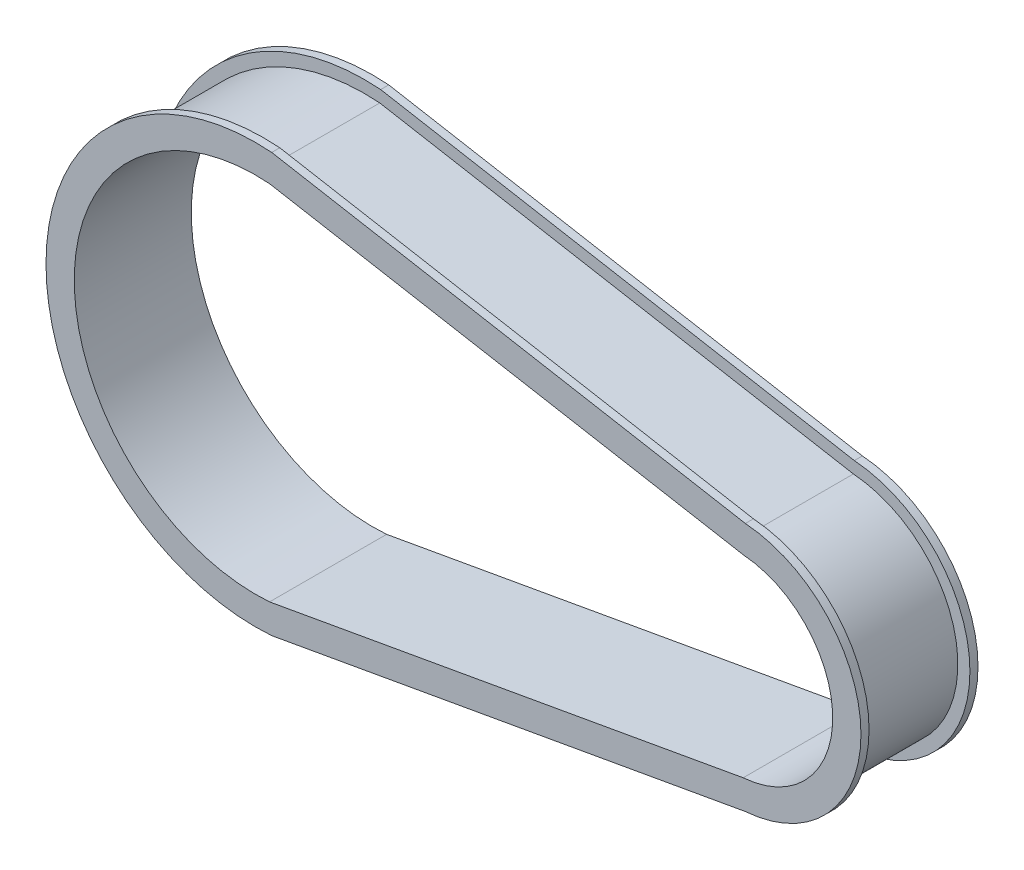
ISO-10303-21;
HEADER;
FILE_DESCRIPTION(('STEP AP214'),'2;1');
FILE_NAME('part.step','',(''),(''),'','','');
FILE_SCHEMA(('AUTOMOTIVE_DESIGN { 1 0 10303 214 1 1 1 1 }'));
ENDSEC;
DATA;
#1=APPLICATION_CONTEXT('core data for automotive mechanical design processes');
#2=APPLICATION_PROTOCOL_DEFINITION('international standard','automotive_design',2000,#1);
#3=PRODUCT_CONTEXT('',#1,'mechanical');
#4=PRODUCT('Part','Part','',(#3));
#5=PRODUCT_RELATED_PRODUCT_CATEGORY('part','',(#4));
#6=PRODUCT_DEFINITION_FORMATION('','',#4);
#7=PRODUCT_DEFINITION_CONTEXT('part definition',#1,'design');
#8=PRODUCT_DEFINITION('design','',#6,#7);
#9=PRODUCT_DEFINITION_SHAPE('','',#8);
#10=(LENGTH_UNIT() NAMED_UNIT(*) SI_UNIT(.MILLI.,.METRE.));
#11=(NAMED_UNIT(*) PLANE_ANGLE_UNIT() SI_UNIT($,.RADIAN.));
#12=(NAMED_UNIT(*) SI_UNIT($,.STERADIAN.) SOLID_ANGLE_UNIT());
#13=UNCERTAINTY_MEASURE_WITH_UNIT(LENGTH_MEASURE(1.E-05),#10,'distance_accuracy_value','');
#14=(GEOMETRIC_REPRESENTATION_CONTEXT(3) GLOBAL_UNCERTAINTY_ASSIGNED_CONTEXT((#13)) GLOBAL_UNIT_ASSIGNED_CONTEXT((#10,
#11,#12)) REPRESENTATION_CONTEXT('',''));
#15=CARTESIAN_POINT('',(0.,0.,0.));
#16=DIRECTION('',(0.,0.,1.));
#17=DIRECTION('',(1.,0.,0.));
#18=AXIS2_PLACEMENT_3D('',#15,#16,#17);
#19=CARTESIAN_POINT('',(0.,0.,6.25));
#20=DIRECTION('',(0.,0.,-1.));
#21=DIRECTION('',(-1.,0.,0.));
#22=AXIS2_PLACEMENT_3D('',#19,#20,#21);
#23=CYLINDRICAL_SURFACE('',#22,12.25);
#24=CARTESIAN_POINT('',(0.,0.,0.));
#25=DIRECTION('',(0.,0.,1.));
#26=DIRECTION('',(1.,0.,0.));
#27=AXIS2_PLACEMENT_3D('',#24,#25,#26);
#28=CIRCLE('',#27,12.25);
#29=CARTESIAN_POINT('',(0.926782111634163,12.2148915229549,0.));
#30=VERTEX_POINT('',#29);
#31=CARTESIAN_POINT('',(0.926782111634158,-12.2148915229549,0.));
#32=VERTEX_POINT('',#31);
#33=EDGE_CURVE('E248',#30,#32,#28,.T.);
#34=ORIENTED_EDGE('',*,*,#33,.T.);
#35=DIRECTION('',(0.,0.,-1.));
#36=VECTOR('',#35,1.);
#37=CARTESIAN_POINT('',(0.926782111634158,-12.2148915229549,6.25));
#38=LINE('',#37,#36);
#39=CARTESIAN_POINT('',(0.926782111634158,-12.2148915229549,6.25));
#40=VERTEX_POINT('',#39);
#41=EDGE_CURVE('E11',#40,#32,#38,.T.);
#42=ORIENTED_EDGE('',*,*,#41,.F.);
#43=CARTESIAN_POINT('',(0.,0.,6.25));
#44=DIRECTION('',(0.,0.,1.));
#45=DIRECTION('',(1.,0.,0.));
#46=AXIS2_PLACEMENT_3D('',#43,#44,#45);
#47=CIRCLE('',#46,12.25);
#48=CARTESIAN_POINT('',(0.926782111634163,12.2148915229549,6.25));
#49=VERTEX_POINT('',#48);
#50=EDGE_CURVE('E258',#49,#40,#47,.T.);
#51=ORIENTED_EDGE('',*,*,#50,.F.);
#52=DIRECTION('',(0.,0.,-1.));
#53=VECTOR('',#52,1.);
#54=CARTESIAN_POINT('',(0.926782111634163,12.2148915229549,6.25));
#55=LINE('',#54,#53);
#56=EDGE_CURVE('E270',#49,#30,#55,.T.);
#57=ORIENTED_EDGE('',*,*,#56,.T.);
#58=EDGE_LOOP('',(#34,#42,#51,#57));
#59=FACE_BOUND('',#58,.T.);
#60=ADVANCED_FACE('F30',(#59),#23,.T.);
#61=CARTESIAN_POINT('',(0.926782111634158,-12.2148915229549,6.25));
#62=DIRECTION('',(-0.175633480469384,0.984455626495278,0.));
#63=DIRECTION('',(-0.984455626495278,-0.175633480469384,0.));
#64=AXIS2_PLACEMENT_3D('',#61,#62,#63);
#65=PLANE('',#64);
#66=DIRECTION('',(0.984455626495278,0.175633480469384,0.));
#67=VECTOR('',#66,1.);
#68=CARTESIAN_POINT('',(0.926782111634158,-12.2148915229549,0.));
#69=LINE('',#68,#67);
#70=CARTESIAN_POINT('',(30.2695897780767,-6.97993801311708,0.));
#71=VERTEX_POINT('',#70);
#72=EDGE_CURVE('E251',#32,#71,#69,.T.);
#73=ORIENTED_EDGE('',*,*,#72,.T.);
#74=DIRECTION('',(0.,0.,-1.));
#75=VECTOR('',#74,1.);
#76=CARTESIAN_POINT('',(30.2695897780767,-6.97993801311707,6.25));
#77=LINE('',#76,#75);
#78=CARTESIAN_POINT('',(30.2695897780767,-6.97993801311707,6.25));
#79=VERTEX_POINT('',#78);
#80=EDGE_CURVE('E37',#79,#71,#77,.T.);
#81=ORIENTED_EDGE('',*,*,#80,.F.);
#82=DIRECTION('',(0.984455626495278,0.175633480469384,0.));
#83=VECTOR('',#82,1.);
#84=CARTESIAN_POINT('',(0.926782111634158,-12.2148915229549,6.25));
#85=LINE('',#84,#83);
#86=EDGE_CURVE('E261',#40,#79,#85,.T.);
#87=ORIENTED_EDGE('',*,*,#86,.F.);
#88=ORIENTED_EDGE('',*,*,#41,.T.);
#89=EDGE_LOOP('',(#73,#81,#87,#88));
#90=FACE_BOUND('',#89,.T.);
#91=ADVANCED_FACE('F277',(#90),#65,.F.);
#92=CARTESIAN_POINT('',(29.74,0.,6.25));
#93=DIRECTION('',(0.,0.,-1.));
#94=DIRECTION('',(-1.,0.,0.));
#95=AXIS2_PLACEMENT_3D('',#92,#93,#94);
#96=CYLINDRICAL_SURFACE('',#95,7.);
#97=CARTESIAN_POINT('',(29.74,0.,0.));
#98=DIRECTION('',(0.,0.,1.));
#99=DIRECTION('',(1.,0.,0.));
#100=AXIS2_PLACEMENT_3D('',#97,#98,#99);
#101=CIRCLE('',#100,7.);
#102=CARTESIAN_POINT('',(30.2695897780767,6.97993801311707,0.));
#103=VERTEX_POINT('',#102);
#104=EDGE_CURVE('E253',#71,#103,#101,.T.);
#105=ORIENTED_EDGE('',*,*,#104,.T.);
#106=DIRECTION('',(0.,0.,-1.));
#107=VECTOR('',#106,1.);
#108=CARTESIAN_POINT('',(30.2695897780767,6.97993801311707,6.25));
#109=LINE('',#108,#107);
#110=CARTESIAN_POINT('',(30.2695897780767,6.97993801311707,6.25));
#111=VERTEX_POINT('',#110);
#112=EDGE_CURVE('E44',#111,#103,#109,.T.);
#113=ORIENTED_EDGE('',*,*,#112,.F.);
#114=CARTESIAN_POINT('',(29.74,0.,6.25));
#115=DIRECTION('',(0.,0.,1.));
#116=DIRECTION('',(1.,0.,0.));
#117=AXIS2_PLACEMENT_3D('',#114,#115,#116);
#118=CIRCLE('',#117,7.);
#119=EDGE_CURVE('E264',#79,#111,#118,.T.);
#120=ORIENTED_EDGE('',*,*,#119,.F.);
#121=ORIENTED_EDGE('',*,*,#80,.T.);
#122=EDGE_LOOP('',(#105,#113,#120,#121));
#123=FACE_BOUND('',#122,.T.);
#124=ADVANCED_FACE('F273',(#123),#96,.T.);
#125=CARTESIAN_POINT('',(0.926782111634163,12.2148915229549,6.25));
#126=DIRECTION('',(-0.175633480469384,-0.984455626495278,0.));
#127=DIRECTION('',(0.984455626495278,-0.175633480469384,0.));
#128=AXIS2_PLACEMENT_3D('',#125,#126,#127);
#129=PLANE('',#128);
#130=DIRECTION('',(-0.984455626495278,0.175633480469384,0.));
#131=VECTOR('',#130,1.);
#132=CARTESIAN_POINT('',(0.926782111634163,12.2148915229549,0.));
#133=LINE('',#132,#131);
#134=EDGE_CURVE('E255',#103,#30,#133,.T.);
#135=ORIENTED_EDGE('',*,*,#134,.T.);
#136=ORIENTED_EDGE('',*,*,#56,.F.);
#137=DIRECTION('',(-0.984455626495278,0.175633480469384,0.));
#138=VECTOR('',#137,1.);
#139=CARTESIAN_POINT('',(0.926782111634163,12.2148915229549,6.25));
#140=LINE('',#139,#138);
#141=EDGE_CURVE('E267',#111,#49,#140,.T.);
#142=ORIENTED_EDGE('',*,*,#141,.F.);
#143=ORIENTED_EDGE('',*,*,#112,.T.);
#144=EDGE_LOOP('',(#135,#136,#142,#143));
#145=FACE_BOUND('',#144,.T.);
#146=ADVANCED_FACE('F283',(#145),#129,.F.);
#147=CARTESIAN_POINT('',(0.,0.,6.25));
#148=DIRECTION('',(0.,0.,-1.));
#149=DIRECTION('',(-1.,0.,0.));
#150=AXIS2_PLACEMENT_3D('',#147,#148,#149);
#151=CYLINDRICAL_SURFACE('',#150,11.25);
#152=DIRECTION('',(0.,0.,-1.));
#153=VECTOR('',#152,1.);
#154=CARTESIAN_POINT('',(0.851126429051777,-11.217757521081,6.25));
#155=LINE('',#154,#153);
#156=CARTESIAN_POINT('',(0.851126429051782,-11.217757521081,6.75));
#157=VERTEX_POINT('',#156);
#158=CARTESIAN_POINT('',(0.851126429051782,-11.217757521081,-0.5));
#159=VERTEX_POINT('',#158);
#160=EDGE_CURVE('E160',#157,#159,#155,.T.);
#161=ORIENTED_EDGE('',*,*,#160,.T.);
#162=CARTESIAN_POINT('',(0.,0.,-0.5));
#163=DIRECTION('',(0.,0.,1.));
#164=DIRECTION('',(1.,0.,0.));
#165=AXIS2_PLACEMENT_3D('',#162,#163,#164);
#166=CIRCLE('',#165,11.25);
#167=CARTESIAN_POINT('',(0.851126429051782,11.217757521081,-0.5));
#168=VERTEX_POINT('',#167);
#169=EDGE_CURVE('E158',#168,#159,#166,.T.);
#170=ORIENTED_EDGE('',*,*,#169,.F.);
#171=DIRECTION('',(0.,0.,-1.));
#172=VECTOR('',#171,1.);
#173=CARTESIAN_POINT('',(0.851126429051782,11.217757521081,6.25));
#174=LINE('',#173,#172);
#175=CARTESIAN_POINT('',(0.851126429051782,11.217757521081,6.75));
#176=VERTEX_POINT('',#175);
#177=EDGE_CURVE('E143',#176,#168,#174,.T.);
#178=ORIENTED_EDGE('',*,*,#177,.F.);
#179=CARTESIAN_POINT('',(0.,0.,6.75));
#180=DIRECTION('',(0.,0.,1.));
#181=DIRECTION('',(1.,0.,0.));
#182=AXIS2_PLACEMENT_3D('',#179,#180,#181);
#183=CIRCLE('',#182,11.25);
#184=EDGE_CURVE('E206',#176,#157,#183,.T.);
#185=ORIENTED_EDGE('',*,*,#184,.T.);
#186=EDGE_LOOP('',(#161,#170,#178,#185));
#187=FACE_BOUND('',#186,.T.);
#188=ADVANCED_FACE('F159',(#187),#151,.F.);
#189=CARTESIAN_POINT('',(0.851126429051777,-11.217757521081,6.25));
#190=DIRECTION('',(-0.175633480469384,0.984455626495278,0.));
#191=DIRECTION('',(-0.984455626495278,-0.175633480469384,0.));
#192=AXIS2_PLACEMENT_3D('',#189,#190,#191);
#193=PLANE('',#192);
#194=DIRECTION('',(0.,0.,-1.));
#195=VECTOR('',#194,1.);
#196=CARTESIAN_POINT('',(30.1939340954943,-5.98280401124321,6.25));
#197=LINE('',#196,#195);
#198=CARTESIAN_POINT('',(30.1939340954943,-5.98280401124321,6.75));
#199=VERTEX_POINT('',#198);
#200=CARTESIAN_POINT('',(30.1939340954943,-5.98280401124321,-0.5));
#201=VERTEX_POINT('',#200);
#202=EDGE_CURVE('E245',#199,#201,#197,.T.);
#203=ORIENTED_EDGE('',*,*,#202,.T.);
#204=DIRECTION('',(0.984455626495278,0.175633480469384,0.));
#205=VECTOR('',#204,1.);
#206=CARTESIAN_POINT('',(0.851126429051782,-11.217757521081,-0.5));
#207=LINE('',#206,#205);
#208=EDGE_CURVE('E170',#159,#201,#207,.T.);
#209=ORIENTED_EDGE('',*,*,#208,.F.);
#210=ORIENTED_EDGE('',*,*,#160,.F.);
#211=DIRECTION('',(0.984455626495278,0.175633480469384,0.));
#212=VECTOR('',#211,1.);
#213=CARTESIAN_POINT('',(0.851126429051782,-11.217757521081,6.75));
#214=LINE('',#213,#212);
#215=EDGE_CURVE('E208',#157,#199,#214,.T.);
#216=ORIENTED_EDGE('',*,*,#215,.T.);
#217=EDGE_LOOP('',(#203,#209,#210,#216));
#218=FACE_BOUND('',#217,.T.);
#219=ADVANCED_FACE('F290',(#218),#193,.T.);
#220=CARTESIAN_POINT('',(29.74,0.,6.25));
#221=DIRECTION('',(0.,0.,-1.));
#222=DIRECTION('',(-1.,0.,0.));
#223=AXIS2_PLACEMENT_3D('',#220,#221,#222);
#224=CYLINDRICAL_SURFACE('',#223,6.);
#225=DIRECTION('',(0.,0.,-1.));
#226=VECTOR('',#225,1.);
#227=CARTESIAN_POINT('',(30.1939340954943,5.9828040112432,6.25));
#228=LINE('',#227,#226);
#229=CARTESIAN_POINT('',(30.1939340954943,5.98280401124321,6.75));
#230=VERTEX_POINT('',#229);
#231=CARTESIAN_POINT('',(30.1939340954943,5.9828040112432,-0.5));
#232=VERTEX_POINT('',#231);
#233=EDGE_CURVE('E154',#230,#232,#228,.T.);
#234=ORIENTED_EDGE('',*,*,#233,.T.);
#235=CARTESIAN_POINT('',(29.74,0.,-0.5));
#236=DIRECTION('',(0.,0.,1.));
#237=DIRECTION('',(1.,0.,0.));
#238=AXIS2_PLACEMENT_3D('',#235,#236,#237);
#239=CIRCLE('',#238,6.);
#240=EDGE_CURVE('E168',#201,#232,#239,.T.);
#241=ORIENTED_EDGE('',*,*,#240,.F.);
#242=ORIENTED_EDGE('',*,*,#202,.F.);
#243=CARTESIAN_POINT('',(29.74,0.,6.75));
#244=DIRECTION('',(0.,0.,1.));
#245=DIRECTION('',(1.,0.,0.));
#246=AXIS2_PLACEMENT_3D('',#243,#244,#245);
#247=CIRCLE('',#246,6.);
#248=EDGE_CURVE('E211',#199,#230,#247,.T.);
#249=ORIENTED_EDGE('',*,*,#248,.T.);
#250=EDGE_LOOP('',(#234,#241,#242,#249));
#251=FACE_BOUND('',#250,.T.);
#252=ADVANCED_FACE('F325',(#251),#224,.F.);
#253=CARTESIAN_POINT('',(0.851126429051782,11.217757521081,6.25));
#254=DIRECTION('',(-0.175633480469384,-0.984455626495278,0.));
#255=DIRECTION('',(0.984455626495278,-0.175633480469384,0.));
#256=AXIS2_PLACEMENT_3D('',#253,#254,#255);
#257=PLANE('',#256);
#258=ORIENTED_EDGE('',*,*,#177,.T.);
#259=DIRECTION('',(-0.984455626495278,0.175633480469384,0.));
#260=VECTOR('',#259,1.);
#261=CARTESIAN_POINT('',(0.851126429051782,11.217757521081,-0.5));
#262=LINE('',#261,#260);
#263=EDGE_CURVE('E147',#232,#168,#262,.T.);
#264=ORIENTED_EDGE('',*,*,#263,.F.);
#265=ORIENTED_EDGE('',*,*,#233,.F.);
#266=DIRECTION('',(-0.984455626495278,0.175633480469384,0.));
#267=VECTOR('',#266,1.);
#268=CARTESIAN_POINT('',(0.851126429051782,11.217757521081,6.75));
#269=LINE('',#268,#267);
#270=EDGE_CURVE('E150',#230,#176,#269,.T.);
#271=ORIENTED_EDGE('',*,*,#270,.T.);
#272=EDGE_LOOP('',(#258,#264,#265,#271));
#273=FACE_BOUND('',#272,.T.);
#274=ADVANCED_FACE('F145',(#273),#257,.T.);
#275=CARTESIAN_POINT('',(0.,0.,6.25));
#276=DIRECTION('',(0.,0.,1.));
#277=DIRECTION('',(1.,0.,0.));
#278=AXIS2_PLACEMENT_3D('',#275,#276,#277);
#279=PLANE('',#278);
#280=CARTESIAN_POINT('',(0.,0.,6.25));
#281=DIRECTION('',(0.,0.,1.));
#282=DIRECTION('',(1.,0.,0.));
#283=AXIS2_PLACEMENT_3D('',#280,#281,#282);
#284=CIRCLE('',#283,13.);
#285=CARTESIAN_POINT('',(0.983523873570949,12.9627420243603,6.25));
#286=VERTEX_POINT('',#285);
#287=CARTESIAN_POINT('',(0.983523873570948,-12.9627420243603,6.25));
#288=VERTEX_POINT('',#287);
#289=EDGE_CURVE('E215',#286,#288,#284,.T.);
#290=ORIENTED_EDGE('',*,*,#289,.F.);
#291=DIRECTION('',(-0.984455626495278,0.175633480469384,0.));
#292=VECTOR('',#291,1.);
#293=CARTESIAN_POINT('',(0.983523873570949,12.9627420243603,6.25));
#294=LINE('',#293,#292);
#295=CARTESIAN_POINT('',(30.3263315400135,7.72778851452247,6.25));
#296=VERTEX_POINT('',#295);
#297=EDGE_CURVE('E222',#296,#286,#294,.T.);
#298=ORIENTED_EDGE('',*,*,#297,.F.);
#299=CARTESIAN_POINT('',(29.74,0.,6.25));
#300=DIRECTION('',(0.,0.,1.));
#301=DIRECTION('',(1.,0.,0.));
#302=AXIS2_PLACEMENT_3D('',#299,#300,#301);
#303=CIRCLE('',#302,7.75);
#304=CARTESIAN_POINT('',(30.3263315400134,-7.72778851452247,6.25));
#305=VERTEX_POINT('',#304);
#306=EDGE_CURVE('E220',#305,#296,#303,.T.);
#307=ORIENTED_EDGE('',*,*,#306,.F.);
#308=DIRECTION('',(0.984455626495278,0.175633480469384,0.));
#309=VECTOR('',#308,1.);
#310=CARTESIAN_POINT('',(0.983523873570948,-12.9627420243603,6.25));
#311=LINE('',#310,#309);
#312=EDGE_CURVE('E218',#288,#305,#311,.T.);
#313=ORIENTED_EDGE('',*,*,#312,.F.);
#314=EDGE_LOOP('',(#290,#298,#307,#313));
#315=FACE_BOUND('',#314,.T.);
#316=ORIENTED_EDGE('',*,*,#141,.T.);
#317=ORIENTED_EDGE('',*,*,#50,.T.);
#318=ORIENTED_EDGE('',*,*,#86,.T.);
#319=ORIENTED_EDGE('',*,*,#119,.T.);
#320=EDGE_LOOP('',(#316,#317,#318,#319));
#321=FACE_BOUND('',#320,.T.);
#322=ADVANCED_FACE('F275',(#315,#321),#279,.F.);
#323=CARTESIAN_POINT('',(0.,0.,6.75));
#324=DIRECTION('',(0.,0.,1.));
#325=DIRECTION('',(1.,0.,0.));
#326=AXIS2_PLACEMENT_3D('',#323,#324,#325);
#327=PLANE('',#326);
#328=CARTESIAN_POINT('',(0.,0.,6.75));
#329=DIRECTION('',(0.,0.,1.));
#330=DIRECTION('',(1.,0.,0.));
#331=AXIS2_PLACEMENT_3D('',#328,#329,#330);
#332=CIRCLE('',#331,13.);
#333=CARTESIAN_POINT('',(0.983523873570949,12.9627420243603,6.75));
#334=VERTEX_POINT('',#333);
#335=CARTESIAN_POINT('',(0.983523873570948,-12.9627420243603,6.75));
#336=VERTEX_POINT('',#335);
#337=EDGE_CURVE('E224',#334,#336,#332,.T.);
#338=ORIENTED_EDGE('',*,*,#337,.T.);
#339=DIRECTION('',(0.984455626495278,0.175633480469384,0.));
#340=VECTOR('',#339,1.);
#341=CARTESIAN_POINT('',(0.983523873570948,-12.9627420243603,6.75));
#342=LINE('',#341,#340);
#343=CARTESIAN_POINT('',(30.3263315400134,-7.72778851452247,6.75));
#344=VERTEX_POINT('',#343);
#345=EDGE_CURVE('E227',#336,#344,#342,.T.);
#346=ORIENTED_EDGE('',*,*,#345,.T.);
#347=CARTESIAN_POINT('',(29.74,0.,6.75));
#348=DIRECTION('',(0.,0.,1.));
#349=DIRECTION('',(1.,0.,0.));
#350=AXIS2_PLACEMENT_3D('',#347,#348,#349);
#351=CIRCLE('',#350,7.75);
#352=CARTESIAN_POINT('',(30.3263315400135,7.72778851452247,6.75));
#353=VERTEX_POINT('',#352);
#354=EDGE_CURVE('E229',#344,#353,#351,.T.);
#355=ORIENTED_EDGE('',*,*,#354,.T.);
#356=DIRECTION('',(-0.984455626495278,0.175633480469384,0.));
#357=VECTOR('',#356,1.);
#358=CARTESIAN_POINT('',(0.983523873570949,12.9627420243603,6.75));
#359=LINE('',#358,#357);
#360=EDGE_CURVE('E231',#353,#334,#359,.T.);
#361=ORIENTED_EDGE('',*,*,#360,.T.);
#362=EDGE_LOOP('',(#338,#346,#355,#361));
#363=FACE_BOUND('',#362,.T.);
#364=ORIENTED_EDGE('',*,*,#215,.F.);
#365=ORIENTED_EDGE('',*,*,#184,.F.);
#366=ORIENTED_EDGE('',*,*,#270,.F.);
#367=ORIENTED_EDGE('',*,*,#248,.F.);
#368=EDGE_LOOP('',(#364,#365,#366,#367));
#369=FACE_BOUND('',#368,.T.);
#370=ADVANCED_FACE('F412',(#363,#369),#327,.T.);
#371=CARTESIAN_POINT('',(0.,0.,6.75));
#372=DIRECTION('',(0.,0.,-1.));
#373=DIRECTION('',(-1.,0.,0.));
#374=AXIS2_PLACEMENT_3D('',#371,#372,#373);
#375=CYLINDRICAL_SURFACE('',#374,13.);
#376=ORIENTED_EDGE('',*,*,#289,.T.);
#377=DIRECTION('',(0.,0.,-1.));
#378=VECTOR('',#377,1.);
#379=CARTESIAN_POINT('',(0.983523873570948,-12.9627420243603,6.75));
#380=LINE('',#379,#378);
#381=EDGE_CURVE('E155',#336,#288,#380,.T.);
#382=ORIENTED_EDGE('',*,*,#381,.F.);
#383=ORIENTED_EDGE('',*,*,#337,.F.);
#384=DIRECTION('',(0.,0.,-1.));
#385=VECTOR('',#384,1.);
#386=CARTESIAN_POINT('',(0.983523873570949,12.9627420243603,6.75));
#387=LINE('',#386,#385);
#388=EDGE_CURVE('E233',#334,#286,#387,.T.);
#389=ORIENTED_EDGE('',*,*,#388,.T.);
#390=EDGE_LOOP('',(#376,#382,#383,#389));
#391=FACE_BOUND('',#390,.T.);
#392=ADVANCED_FACE('F416',(#391),#375,.T.);
#393=CARTESIAN_POINT('',(0.983523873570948,-12.9627420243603,6.75));
#394=DIRECTION('',(-0.175633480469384,0.984455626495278,0.));
#395=DIRECTION('',(-0.984455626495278,-0.175633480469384,0.));
#396=AXIS2_PLACEMENT_3D('',#393,#394,#395);
#397=PLANE('',#396);
#398=ORIENTED_EDGE('',*,*,#312,.T.);
#399=DIRECTION('',(0.,0.,-1.));
#400=VECTOR('',#399,1.);
#401=CARTESIAN_POINT('',(30.3263315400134,-7.72778851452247,6.75));
#402=LINE('',#401,#400);
#403=EDGE_CURVE('E239',#344,#305,#402,.T.);
#404=ORIENTED_EDGE('',*,*,#403,.F.);
#405=ORIENTED_EDGE('',*,*,#345,.F.);
#406=ORIENTED_EDGE('',*,*,#381,.T.);
#407=EDGE_LOOP('',(#398,#404,#405,#406));
#408=FACE_BOUND('',#407,.T.);
#409=ADVANCED_FACE('F423',(#408),#397,.F.);
#410=CARTESIAN_POINT('',(29.74,0.,6.75));
#411=DIRECTION('',(0.,0.,-1.));
#412=DIRECTION('',(-1.,0.,0.));
#413=AXIS2_PLACEMENT_3D('',#410,#411,#412);
#414=CYLINDRICAL_SURFACE('',#413,7.75);
#415=ORIENTED_EDGE('',*,*,#306,.T.);
#416=DIRECTION('',(0.,0.,-1.));
#417=VECTOR('',#416,1.);
#418=CARTESIAN_POINT('',(30.3263315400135,7.72778851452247,6.75));
#419=LINE('',#418,#417);
#420=EDGE_CURVE('E236',#353,#296,#419,.T.);
#421=ORIENTED_EDGE('',*,*,#420,.F.);
#422=ORIENTED_EDGE('',*,*,#354,.F.);
#423=ORIENTED_EDGE('',*,*,#403,.T.);
#424=EDGE_LOOP('',(#415,#421,#422,#423));
#425=FACE_BOUND('',#424,.T.);
#426=ADVANCED_FACE('F419',(#425),#414,.T.);
#427=CARTESIAN_POINT('',(0.983523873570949,12.9627420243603,6.75));
#428=DIRECTION('',(-0.175633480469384,-0.984455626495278,0.));
#429=DIRECTION('',(0.984455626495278,-0.175633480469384,0.));
#430=AXIS2_PLACEMENT_3D('',#427,#428,#429);
#431=PLANE('',#430);
#432=ORIENTED_EDGE('',*,*,#297,.T.);
#433=ORIENTED_EDGE('',*,*,#388,.F.);
#434=ORIENTED_EDGE('',*,*,#360,.F.);
#435=ORIENTED_EDGE('',*,*,#420,.T.);
#436=EDGE_LOOP('',(#432,#433,#434,#435));
#437=FACE_BOUND('',#436,.T.);
#438=ADVANCED_FACE('F357',(#437),#431,.F.);
#439=CARTESIAN_POINT('',(0.,0.,0.));
#440=DIRECTION('',(0.,0.,-1.));
#441=DIRECTION('',(1.,0.,0.));
#442=AXIS2_PLACEMENT_3D('',#439,#440,#441);
#443=PLANE('',#442);
#444=CARTESIAN_POINT('',(0.,0.,0.));
#445=DIRECTION('',(0.,0.,1.));
#446=DIRECTION('',(1.,0.,0.));
#447=AXIS2_PLACEMENT_3D('',#444,#445,#446);
#448=CIRCLE('',#447,13.);
#449=CARTESIAN_POINT('',(0.983523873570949,12.9627420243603,0.));
#450=VERTEX_POINT('',#449);
#451=CARTESIAN_POINT('',(0.983523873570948,-12.9627420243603,0.));
#452=VERTEX_POINT('',#451);
#453=EDGE_CURVE('E174',#450,#452,#448,.T.);
#454=ORIENTED_EDGE('',*,*,#453,.T.);
#455=DIRECTION('',(0.984455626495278,0.175633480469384,0.));
#456=VECTOR('',#455,1.);
#457=CARTESIAN_POINT('',(0.983523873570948,-12.9627420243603,0.));
#458=LINE('',#457,#456);
#459=CARTESIAN_POINT('',(30.3263315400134,-7.72778851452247,0.));
#460=VERTEX_POINT('',#459);
#461=EDGE_CURVE('E183',#452,#460,#458,.T.);
#462=ORIENTED_EDGE('',*,*,#461,.T.);
#463=CARTESIAN_POINT('',(29.74,0.,0.));
#464=DIRECTION('',(0.,0.,1.));
#465=DIRECTION('',(1.,0.,0.));
#466=AXIS2_PLACEMENT_3D('',#463,#464,#465);
#467=CIRCLE('',#466,7.75);
#468=CARTESIAN_POINT('',(30.3263315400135,7.72778851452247,0.));
#469=VERTEX_POINT('',#468);
#470=EDGE_CURVE('E180',#460,#469,#467,.T.);
#471=ORIENTED_EDGE('',*,*,#470,.T.);
#472=DIRECTION('',(-0.984455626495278,0.175633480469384,0.));
#473=VECTOR('',#472,1.);
#474=CARTESIAN_POINT('',(0.983523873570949,12.9627420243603,0.));
#475=LINE('',#474,#473);
#476=EDGE_CURVE('E177',#469,#450,#475,.T.);
#477=ORIENTED_EDGE('',*,*,#476,.T.);
#478=EDGE_LOOP('',(#454,#462,#471,#477));
#479=FACE_BOUND('',#478,.T.);
#480=ORIENTED_EDGE('',*,*,#72,.F.);
#481=ORIENTED_EDGE('',*,*,#33,.F.);
#482=ORIENTED_EDGE('',*,*,#134,.F.);
#483=ORIENTED_EDGE('',*,*,#104,.F.);
#484=EDGE_LOOP('',(#480,#481,#482,#483));
#485=FACE_BOUND('',#484,.T.);
#486=ADVANCED_FACE('F281',(#479,#485),#443,.F.);
#487=CARTESIAN_POINT('',(0.,0.,-0.5));
#488=DIRECTION('',(0.,0.,1.));
#489=DIRECTION('',(1.,0.,0.));
#490=AXIS2_PLACEMENT_3D('',#487,#488,#489);
#491=CYLINDRICAL_SURFACE('',#490,13.);
#492=ORIENTED_EDGE('',*,*,#453,.F.);
#493=DIRECTION('',(0.,0.,1.));
#494=VECTOR('',#493,1.);
#495=CARTESIAN_POINT('',(0.983523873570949,12.9627420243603,-0.5));
#496=LINE('',#495,#494);
#497=CARTESIAN_POINT('',(0.983523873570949,12.9627420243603,-0.5));
#498=VERTEX_POINT('',#497);
#499=EDGE_CURVE('E204',#498,#450,#496,.T.);
#500=ORIENTED_EDGE('',*,*,#499,.F.);
#501=CARTESIAN_POINT('',(0.,0.,-0.5));
#502=DIRECTION('',(0.,0.,1.));
#503=DIRECTION('',(1.,0.,0.));
#504=AXIS2_PLACEMENT_3D('',#501,#502,#503);
#505=CIRCLE('',#504,13.);
#506=CARTESIAN_POINT('',(0.983523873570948,-12.9627420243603,-0.5));
#507=VERTEX_POINT('',#506);
#508=EDGE_CURVE('E186',#498,#507,#505,.T.);
#509=ORIENTED_EDGE('',*,*,#508,.T.);
#510=DIRECTION('',(0.,0.,1.));
#511=VECTOR('',#510,1.);
#512=CARTESIAN_POINT('',(0.983523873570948,-12.9627420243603,-0.5));
#513=LINE('',#512,#511);
#514=EDGE_CURVE('E198',#507,#452,#513,.T.);
#515=ORIENTED_EDGE('',*,*,#514,.T.);
#516=EDGE_LOOP('',(#492,#500,#509,#515));
#517=FACE_BOUND('',#516,.T.);
#518=ADVANCED_FACE('F356',(#517),#491,.T.);
#519=CARTESIAN_POINT('',(0.983523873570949,12.9627420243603,-0.5));
#520=DIRECTION('',(0.175633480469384,0.984455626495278,0.));
#521=DIRECTION('',(-0.984455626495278,0.175633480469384,0.));
#522=AXIS2_PLACEMENT_3D('',#519,#520,#521);
#523=PLANE('',#522);
#524=ORIENTED_EDGE('',*,*,#476,.F.);
#525=DIRECTION('',(0.,0.,1.));
#526=VECTOR('',#525,1.);
#527=CARTESIAN_POINT('',(30.3263315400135,7.72778851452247,-0.5));
#528=LINE('',#527,#526);
#529=CARTESIAN_POINT('',(30.3263315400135,7.72778851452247,-0.5));
#530=VERTEX_POINT('',#529);
#531=EDGE_CURVE('E202',#530,#469,#528,.T.);
#532=ORIENTED_EDGE('',*,*,#531,.F.);
#533=DIRECTION('',(-0.984455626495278,0.175633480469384,0.));
#534=VECTOR('',#533,1.);
#535=CARTESIAN_POINT('',(0.983523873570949,12.9627420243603,-0.5));
#536=LINE('',#535,#534);
#537=EDGE_CURVE('E189',#530,#498,#536,.T.);
#538=ORIENTED_EDGE('',*,*,#537,.T.);
#539=ORIENTED_EDGE('',*,*,#499,.T.);
#540=EDGE_LOOP('',(#524,#532,#538,#539));
#541=FACE_BOUND('',#540,.T.);
#542=ADVANCED_FACE('F368',(#541),#523,.T.);
#543=CARTESIAN_POINT('',(29.74,0.,-0.5));
#544=DIRECTION('',(0.,0.,1.));
#545=DIRECTION('',(1.,0.,0.));
#546=AXIS2_PLACEMENT_3D('',#543,#544,#545);
#547=CYLINDRICAL_SURFACE('',#546,7.75);
#548=ORIENTED_EDGE('',*,*,#470,.F.);
#549=DIRECTION('',(0.,0.,1.));
#550=VECTOR('',#549,1.);
#551=CARTESIAN_POINT('',(30.3263315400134,-7.72778851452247,-0.5));
#552=LINE('',#551,#550);
#553=CARTESIAN_POINT('',(30.3263315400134,-7.72778851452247,-0.5));
#554=VERTEX_POINT('',#553);
#555=EDGE_CURVE('E200',#554,#460,#552,.T.);
#556=ORIENTED_EDGE('',*,*,#555,.F.);
#557=CARTESIAN_POINT('',(29.74,0.,-0.5));
#558=DIRECTION('',(0.,0.,1.));
#559=DIRECTION('',(1.,0.,0.));
#560=AXIS2_PLACEMENT_3D('',#557,#558,#559);
#561=CIRCLE('',#560,7.75);
#562=EDGE_CURVE('E192',#554,#530,#561,.T.);
#563=ORIENTED_EDGE('',*,*,#562,.T.);
#564=ORIENTED_EDGE('',*,*,#531,.T.);
#565=EDGE_LOOP('',(#548,#556,#563,#564));
#566=FACE_BOUND('',#565,.T.);
#567=ADVANCED_FACE('F378',(#566),#547,.T.);
#568=CARTESIAN_POINT('',(0.983523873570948,-12.9627420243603,-0.5));
#569=DIRECTION('',(0.175633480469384,-0.984455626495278,0.));
#570=DIRECTION('',(0.984455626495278,0.175633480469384,0.));
#571=AXIS2_PLACEMENT_3D('',#568,#569,#570);
#572=PLANE('',#571);
#573=ORIENTED_EDGE('',*,*,#461,.F.);
#574=ORIENTED_EDGE('',*,*,#514,.F.);
#575=DIRECTION('',(0.984455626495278,0.175633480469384,0.));
#576=VECTOR('',#575,1.);
#577=CARTESIAN_POINT('',(0.983523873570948,-12.9627420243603,-0.5));
#578=LINE('',#577,#576);
#579=EDGE_CURVE('E195',#507,#554,#578,.T.);
#580=ORIENTED_EDGE('',*,*,#579,.T.);
#581=ORIENTED_EDGE('',*,*,#555,.T.);
#582=EDGE_LOOP('',(#573,#574,#580,#581));
#583=FACE_BOUND('',#582,.T.);
#584=ADVANCED_FACE('F388',(#583),#572,.T.);
#585=CARTESIAN_POINT('',(0.,0.,-0.5));
#586=DIRECTION('',(0.,0.,-1.));
#587=DIRECTION('',(1.,0.,0.));
#588=AXIS2_PLACEMENT_3D('',#585,#586,#587);
#589=PLANE('',#588);
#590=ORIENTED_EDGE('',*,*,#169,.T.);
#591=ORIENTED_EDGE('',*,*,#208,.T.);
#592=ORIENTED_EDGE('',*,*,#240,.T.);
#593=ORIENTED_EDGE('',*,*,#263,.T.);
#594=EDGE_LOOP('',(#590,#591,#592,#593));
#595=FACE_BOUND('',#594,.T.);
#596=ORIENTED_EDGE('',*,*,#508,.F.);
#597=ORIENTED_EDGE('',*,*,#537,.F.);
#598=ORIENTED_EDGE('',*,*,#562,.F.);
#599=ORIENTED_EDGE('',*,*,#579,.F.);
#600=EDGE_LOOP('',(#596,#597,#598,#599));
#601=FACE_BOUND('',#600,.T.);
#602=ADVANCED_FACE('F165',(#595,#601),#589,.T.);
#603=CLOSED_SHELL('',(#60,#91,#124,#146,#188,#219,#252,#274,#322,#370,#392,#409,#426,#438,#486,
#518,#542,#567,#584,#602));
#604=MANIFOLD_SOLID_BREP('B2',#603);
#605=ADVANCED_BREP_SHAPE_REPRESENTATION('',(#18,#604),#14);
#606=SHAPE_DEFINITION_REPRESENTATION(#9,#605);
ENDSEC;
END-ISO-10303-21;
